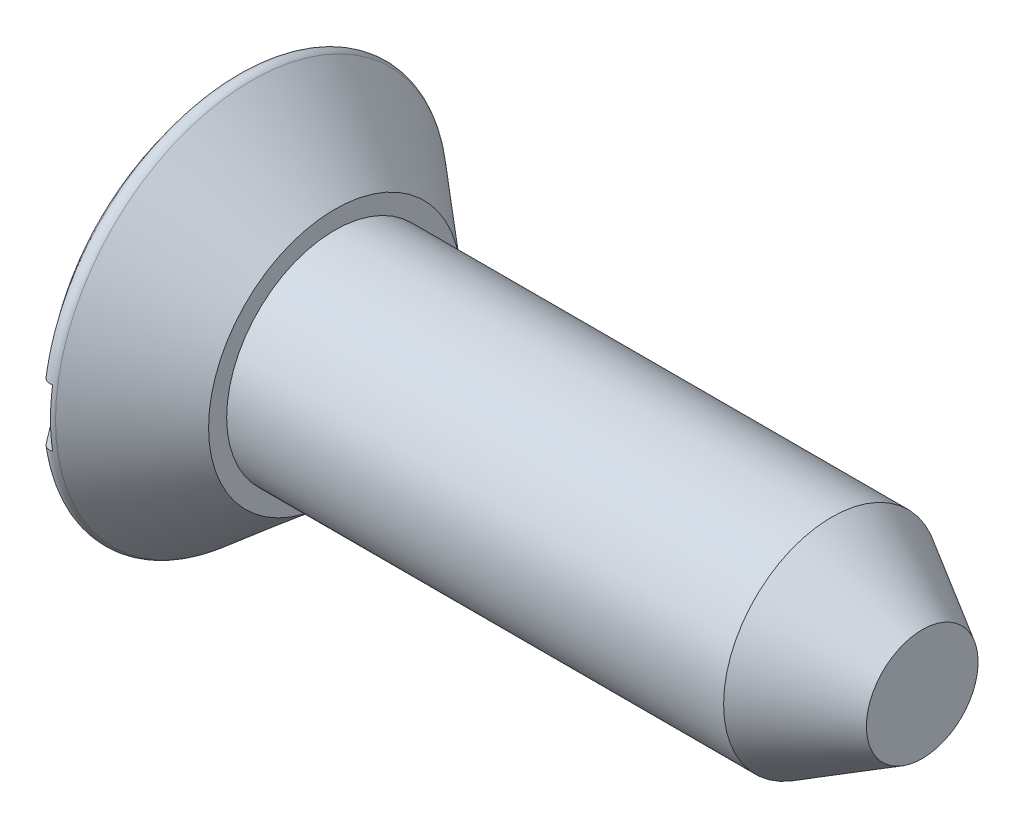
from build123d import *

# Parameters (mm, degrees)
SLOT_CUT_EXTRUDE1_DEPTH      = 6.167561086
SLOT_CUT_EXTRUDE1_DEPTH_BACK = 6.167561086
SKETCH2_W                    = 0.5588
SKETCH2_H                    = 0.4064


with BuildPart() as part:
    # Sketch1 → base-Revolve (revolve)
    with BuildSketch(Plane.XY, mode=Mode.PRIVATE) as base_revolve_sk:
        with BuildLine():
            Line((0.048416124, 1.381774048), (0.635, 0.889571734))
            Line((0.635, 0.889571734), (0.635, 0.762))
            Line((0.635, 0.762), (4.7752, 0.762))
            Line((4.7752, 0.762), (4.7752, 0))
            Line((4.7752, 0), (0, 0))
            Line((0, 0), (-0.5334, 0))
            ThreePointArc((-0.5334, 0), (-0.406704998, 0.729445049), (-0.041460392, 1.373446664))
            ThreePointArc((-0.041460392, 1.373446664), (0.001740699, 1.396359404), (0.048416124, 1.381774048))
        make_face()
    revolve(base_revolve_sk.sketch.rotate(Axis((0, 0, 0), (1, 0, 0)), 90), axis=Axis((0, 0, 0), (1, 0, 0)))

    # Sketch2 → slot_Cut-Extrude1 (cut, two sides: drawn at the far end of the back side and taken through both)
    with BuildSketch(Plane.XY.offset(-SLOT_CUT_EXTRUDE1_DEPTH_BACK)):
        with Locations((-0.254, 0)):
            Rectangle(SKETCH2_W, SKETCH2_H)
    extrude(amount=SLOT_CUT_EXTRUDE1_DEPTH + SLOT_CUT_EXTRUDE1_DEPTH_BACK, mode=Mode.SUBTRACT)

    # Sketch8 → point_Cut-Revolve1 (revolve, cut)
    with BuildSketch(Plane.XY, mode=Mode.PRIVATE) as point_cut_revolve1_sk:
        Polygon((4.7752, 0), (5.2832, 0), (5.2832, 1.27), (4.137285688, 1.27), (4.137285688, 0.762), (4.7752, 0.3937), align=None)
    revolve(point_cut_revolve1_sk.sketch.rotate(Axis((0, 0, 0), (1, 0, 0)), 90), axis=Axis((0, 0, 0), (1, 0, 0)), mode=Mode.SUBTRACT)


solid = part.part
